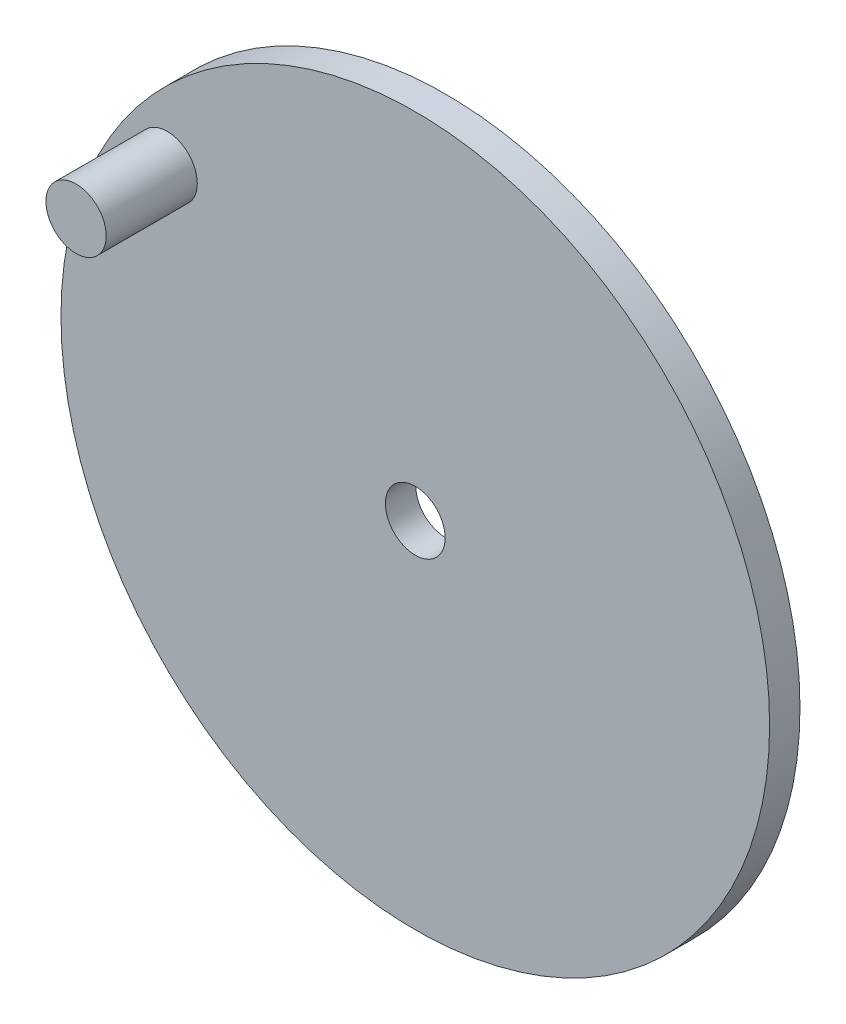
ISO-10303-21;
HEADER;
FILE_DESCRIPTION(('STEP AP214'),'2;1');
FILE_NAME('part.step','',(''),(''),'','','');
FILE_SCHEMA(('AUTOMOTIVE_DESIGN { 1 0 10303 214 1 1 1 1 }'));
ENDSEC;
DATA;
#1=APPLICATION_CONTEXT('core data for automotive mechanical design processes');
#2=APPLICATION_PROTOCOL_DEFINITION('international standard','automotive_design',2000,#1);
#3=PRODUCT_CONTEXT('',#1,'mechanical');
#4=PRODUCT('Part','Part','',(#3));
#5=PRODUCT_RELATED_PRODUCT_CATEGORY('part','',(#4));
#6=PRODUCT_DEFINITION_FORMATION('','',#4);
#7=PRODUCT_DEFINITION_CONTEXT('part definition',#1,'design');
#8=PRODUCT_DEFINITION('design','',#6,#7);
#9=PRODUCT_DEFINITION_SHAPE('','',#8);
#10=(LENGTH_UNIT() NAMED_UNIT(*) SI_UNIT(.MILLI.,.METRE.));
#11=(NAMED_UNIT(*) PLANE_ANGLE_UNIT() SI_UNIT($,.RADIAN.));
#12=(NAMED_UNIT(*) SI_UNIT($,.STERADIAN.) SOLID_ANGLE_UNIT());
#13=UNCERTAINTY_MEASURE_WITH_UNIT(LENGTH_MEASURE(1.E-05),#10,'distance_accuracy_value','');
#14=(GEOMETRIC_REPRESENTATION_CONTEXT(3) GLOBAL_UNCERTAINTY_ASSIGNED_CONTEXT((#13)) GLOBAL_UNIT_ASSIGNED_CONTEXT((#10,
#11,#12)) REPRESENTATION_CONTEXT('',''));
#15=CARTESIAN_POINT('',(0.,0.,0.));
#16=DIRECTION('',(0.,0.,1.));
#17=DIRECTION('',(1.,0.,0.));
#18=AXIS2_PLACEMENT_3D('',#15,#16,#17);
#19=CARTESIAN_POINT('',(-24.5072864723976,18.0863774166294,12.));
#20=DIRECTION('',(0.,0.,-1.));
#21=DIRECTION('',(-1.,0.,0.));
#22=AXIS2_PLACEMENT_3D('',#19,#20,#21);
#23=CYLINDRICAL_SURFACE('',#22,2.975);
#24=CARTESIAN_POINT('',(-24.5072864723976,18.0863774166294,12.));
#25=DIRECTION('',(0.,0.,1.));
#26=DIRECTION('',(1.,0.,0.));
#27=AXIS2_PLACEMENT_3D('',#24,#25,#26);
#28=CIRCLE('',#27,2.975);
#29=CARTESIAN_POINT('',(-21.5322864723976,18.0863774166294,12.));
#30=VERTEX_POINT('',#29);
#31=EDGE_CURVE('E11',#30,#30,#28,.T.);
#32=ORIENTED_EDGE('',*,*,#31,.F.);
#33=EDGE_LOOP('',(#32));
#34=FACE_BOUND('',#33,.T.);
#35=CARTESIAN_POINT('',(-24.5072864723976,18.0863774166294,3.));
#36=DIRECTION('',(0.,0.,1.));
#37=DIRECTION('',(1.,0.,0.));
#38=AXIS2_PLACEMENT_3D('',#35,#36,#37);
#39=CIRCLE('',#38,2.975);
#40=CARTESIAN_POINT('',(-21.5322864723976,18.0863774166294,3.));
#41=VERTEX_POINT('',#40);
#42=EDGE_CURVE('E54',#41,#41,#39,.T.);
#43=ORIENTED_EDGE('',*,*,#42,.T.);
#44=EDGE_LOOP('',(#43));
#45=FACE_BOUND('',#44,.T.);
#46=ADVANCED_FACE('F51',(#34,#45),#23,.T.);
#47=CARTESIAN_POINT('',(-24.5072864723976,18.0863774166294,12.));
#48=DIRECTION('',(0.,0.,1.));
#49=DIRECTION('',(1.,0.,0.));
#50=AXIS2_PLACEMENT_3D('',#47,#48,#49);
#51=PLANE('',#50);
#52=ORIENTED_EDGE('',*,*,#31,.T.);
#53=EDGE_LOOP('',(#52));
#54=FACE_BOUND('',#53,.T.);
#55=ADVANCED_FACE('F66',(#54),#51,.T.);
#56=CARTESIAN_POINT('',(-24.5072864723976,18.0863774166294,3.));
#57=DIRECTION('',(0.,0.,1.));
#58=DIRECTION('',(1.,0.,0.));
#59=AXIS2_PLACEMENT_3D('',#56,#57,#58);
#60=PLANE('',#59);
#61=ORIENTED_EDGE('',*,*,#42,.F.);
#62=EDGE_LOOP('',(#61));
#63=FACE_BOUND('',#62,.T.);
#64=ADVANCED_FACE('F64',(#63),#60,.F.);
#65=CLOSED_SHELL('',(#46,#55,#64));
#66=MANIFOLD_SOLID_BREP('B2',#65);
#67=CARTESIAN_POINT('',(0.,0.,3.));
#68=DIRECTION('',(0.,0.,-1.));
#69=DIRECTION('',(-1.,0.,0.));
#70=AXIS2_PLACEMENT_3D('',#67,#68,#69);
#71=CYLINDRICAL_SURFACE('',#70,35.);
#72=CARTESIAN_POINT('',(0.,0.,3.));
#73=DIRECTION('',(0.,0.,1.));
#74=DIRECTION('',(1.,0.,0.));
#75=AXIS2_PLACEMENT_3D('',#72,#73,#74);
#76=CIRCLE('',#75,35.);
#77=CARTESIAN_POINT('',(35.,0.,3.));
#78=VERTEX_POINT('',#77);
#79=EDGE_CURVE('E50',#78,#78,#76,.T.);
#80=ORIENTED_EDGE('',*,*,#79,.F.);
#81=EDGE_LOOP('',(#80));
#82=FACE_BOUND('',#81,.T.);
#83=CARTESIAN_POINT('',(0.,0.,0.));
#84=DIRECTION('',(0.,0.,1.));
#85=DIRECTION('',(1.,0.,0.));
#86=AXIS2_PLACEMENT_3D('',#83,#84,#85);
#87=CIRCLE('',#86,35.);
#88=CARTESIAN_POINT('',(35.,0.,0.));
#89=VERTEX_POINT('',#88);
#90=EDGE_CURVE('E95',#89,#89,#87,.T.);
#91=ORIENTED_EDGE('',*,*,#90,.T.);
#92=EDGE_LOOP('',(#91));
#93=FACE_BOUND('',#92,.T.);
#94=ADVANCED_FACE('F92',(#82,#93),#71,.T.);
#95=CARTESIAN_POINT('',(0.,0.,3.));
#96=DIRECTION('',(0.,0.,1.));
#97=DIRECTION('',(1.,0.,0.));
#98=AXIS2_PLACEMENT_3D('',#95,#96,#97);
#99=PLANE('',#98);
#100=CARTESIAN_POINT('',(0.,0.,3.));
#101=DIRECTION('',(0.,0.,1.));
#102=DIRECTION('',(1.,0.,0.));
#103=AXIS2_PLACEMENT_3D('',#100,#101,#102);
#104=CIRCLE('',#103,2.95);
#105=CARTESIAN_POINT('',(2.95,0.,3.));
#106=VERTEX_POINT('',#105);
#107=EDGE_CURVE('E109',#106,#106,#104,.T.);
#108=ORIENTED_EDGE('',*,*,#107,.F.);
#109=EDGE_LOOP('',(#108));
#110=FACE_BOUND('',#109,.T.);
#111=ORIENTED_EDGE('',*,*,#79,.T.);
#112=EDGE_LOOP('',(#111));
#113=FACE_BOUND('',#112,.T.);
#114=ADVANCED_FACE('F116',(#110,#113),#99,.T.);
#115=CARTESIAN_POINT('',(0.,0.,0.));
#116=DIRECTION('',(0.,0.,1.));
#117=DIRECTION('',(1.,0.,0.));
#118=AXIS2_PLACEMENT_3D('',#115,#116,#117);
#119=PLANE('',#118);
#120=CARTESIAN_POINT('',(0.,0.,0.));
#121=DIRECTION('',(0.,0.,1.));
#122=DIRECTION('',(1.,0.,0.));
#123=AXIS2_PLACEMENT_3D('',#120,#121,#122);
#124=CIRCLE('',#123,2.95);
#125=CARTESIAN_POINT('',(2.95,0.,0.));
#126=VERTEX_POINT('',#125);
#127=EDGE_CURVE('E104',#126,#126,#124,.F.);
#128=ORIENTED_EDGE('',*,*,#127,.F.);
#129=EDGE_LOOP('',(#128));
#130=FACE_BOUND('',#129,.T.);
#131=ORIENTED_EDGE('',*,*,#90,.F.);
#132=EDGE_LOOP('',(#131));
#133=FACE_BOUND('',#132,.T.);
#134=ADVANCED_FACE('F118',(#130,#133),#119,.F.);
#135=CARTESIAN_POINT('',(0.,0.,-8.34386001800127));
#136=DIRECTION('',(0.,0.,1.));
#137=DIRECTION('',(1.,0.,0.));
#138=AXIS2_PLACEMENT_3D('',#135,#136,#137);
#139=CYLINDRICAL_SURFACE('',#138,2.95);
#140=ORIENTED_EDGE('',*,*,#127,.T.);
#141=EDGE_LOOP('',(#140));
#142=FACE_BOUND('',#141,.T.);
#143=ORIENTED_EDGE('',*,*,#107,.T.);
#144=EDGE_LOOP('',(#143));
#145=FACE_BOUND('',#144,.T.);
#146=ADVANCED_FACE('F114',(#142,#145),#139,.F.);
#147=CLOSED_SHELL('',(#94,#114,#134,#146));
#148=MANIFOLD_SOLID_BREP('B6',#147);
#149=ADVANCED_BREP_SHAPE_REPRESENTATION('',(#18,#66,#148),#14);
#150=SHAPE_DEFINITION_REPRESENTATION(#9,#149);
ENDSEC;
END-ISO-10303-21;
